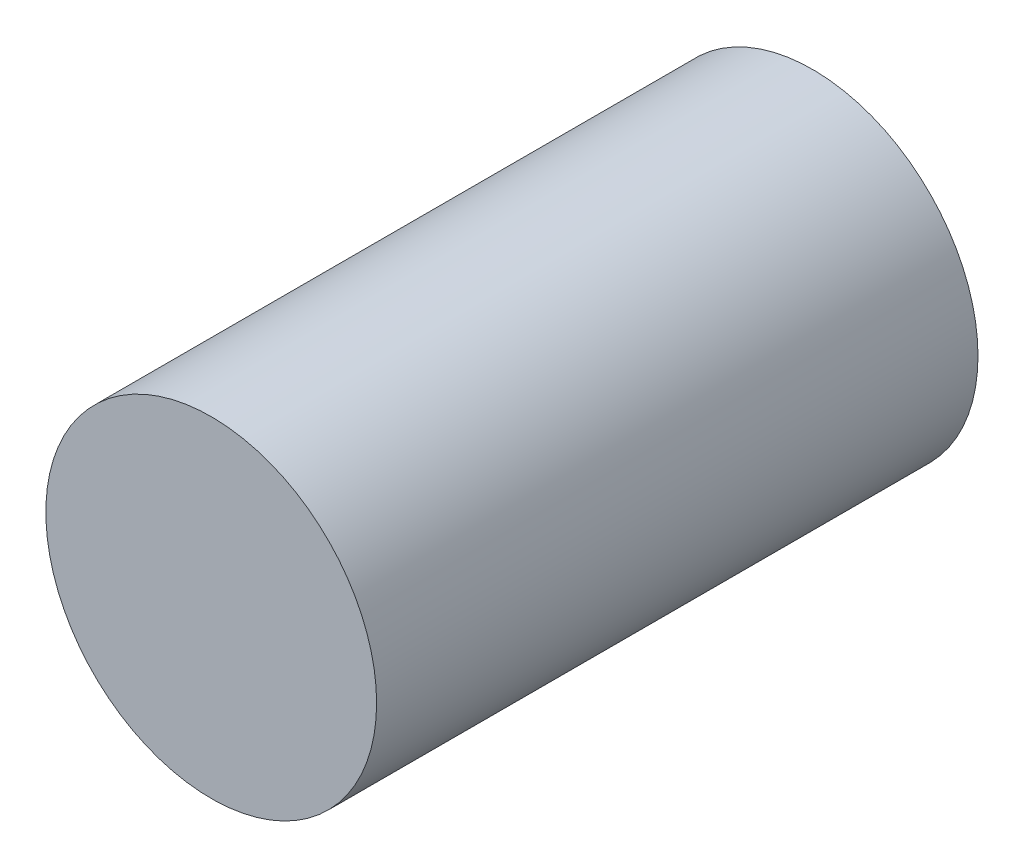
from build123d import *

# Parameters (mm, degrees)
ESQUISSE1_R      = 11
EXTRUSION1_DEPTH = 40
ESQUISSE2_R      = 6
EXTRUSION2_DEPTH = 1


with BuildPart() as part:
    # Esquisse1 → Extrusion1 (new body)
    with BuildSketch(Plane.XY):
        Circle(ESQUISSE1_R)
    extrude(amount=EXTRUSION1_DEPTH)

    # Esquisse2 → Extrusion2 (add)
    with BuildSketch(Plane(origin=(0, 0, 0), x_dir=(-1, 0, 0), z_dir=(0, 0, -1))):
        with Locations(Location((0, 0, 0), (0, 0, 180))):
            Circle(ESQUISSE2_R)
    extrude(amount=EXTRUSION2_DEPTH)


solid = part.part
